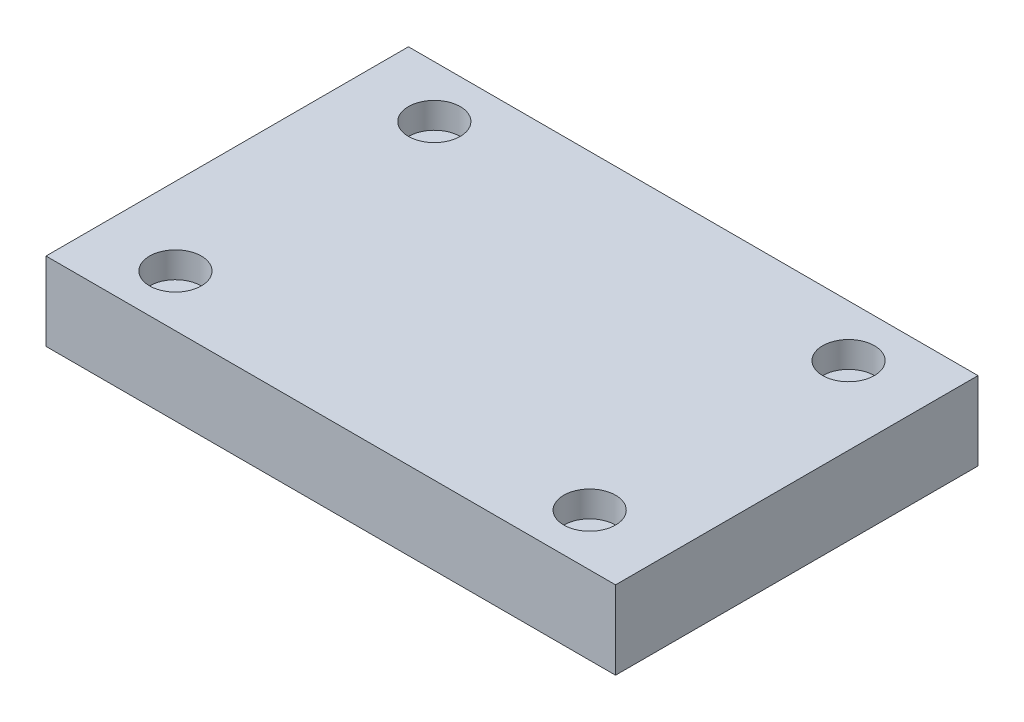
ISO-10303-21;
HEADER;
FILE_DESCRIPTION(('STEP AP214'),'2;1');
FILE_NAME('part.step','',(''),(''),'','','');
FILE_SCHEMA(('AUTOMOTIVE_DESIGN { 1 0 10303 214 1 1 1 1 }'));
ENDSEC;
DATA;
#1=APPLICATION_CONTEXT('core data for automotive mechanical design processes');
#2=APPLICATION_PROTOCOL_DEFINITION('international standard','automotive_design',2000,#1);
#3=PRODUCT_CONTEXT('',#1,'mechanical');
#4=PRODUCT('Part','Part','',(#3));
#5=PRODUCT_RELATED_PRODUCT_CATEGORY('part','',(#4));
#6=PRODUCT_DEFINITION_FORMATION('','',#4);
#7=PRODUCT_DEFINITION_CONTEXT('part definition',#1,'design');
#8=PRODUCT_DEFINITION('design','',#6,#7);
#9=PRODUCT_DEFINITION_SHAPE('','',#8);
#10=(LENGTH_UNIT() NAMED_UNIT(*) SI_UNIT(.MILLI.,.METRE.));
#11=(NAMED_UNIT(*) PLANE_ANGLE_UNIT() SI_UNIT($,.RADIAN.));
#12=(NAMED_UNIT(*) SI_UNIT($,.STERADIAN.) SOLID_ANGLE_UNIT());
#13=UNCERTAINTY_MEASURE_WITH_UNIT(LENGTH_MEASURE(1.E-05),#10,'distance_accuracy_value','');
#14=(GEOMETRIC_REPRESENTATION_CONTEXT(3) GLOBAL_UNCERTAINTY_ASSIGNED_CONTEXT((#13)) GLOBAL_UNIT_ASSIGNED_CONTEXT((#10,
#11,#12)) REPRESENTATION_CONTEXT('',''));
#15=CARTESIAN_POINT('',(0.,0.,0.));
#16=DIRECTION('',(0.,0.,1.));
#17=DIRECTION('',(1.,0.,0.));
#18=AXIS2_PLACEMENT_3D('',#15,#16,#17);
#19=CARTESIAN_POINT('',(-69.85,19.203523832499,-44.45));
#20=DIRECTION('',(1.,0.,0.));
#21=DIRECTION('',(0.,0.,-1.));
#22=AXIS2_PLACEMENT_3D('',#19,#20,#21);
#23=PLANE('',#22);
#24=DIRECTION('',(0.,0.,1.));
#25=VECTOR('',#24,1.);
#26=CARTESIAN_POINT('',(-69.85,0.,-44.45));
#27=LINE('',#26,#25);
#28=CARTESIAN_POINT('',(-69.85,0.,-44.45));
#29=VERTEX_POINT('',#28);
#30=CARTESIAN_POINT('',(-69.85,0.,44.45));
#31=VERTEX_POINT('',#30);
#32=EDGE_CURVE('E85',#29,#31,#27,.T.);
#33=ORIENTED_EDGE('',*,*,#32,.T.);
#34=DIRECTION('',(0.,-1.,0.));
#35=VECTOR('',#34,1.);
#36=CARTESIAN_POINT('',(-69.85,19.203523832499,44.45));
#37=LINE('',#36,#35);
#38=CARTESIAN_POINT('',(-69.85,19.203523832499,44.45));
#39=VERTEX_POINT('',#38);
#40=EDGE_CURVE('E12',#39,#31,#37,.T.);
#41=ORIENTED_EDGE('',*,*,#40,.F.);
#42=DIRECTION('',(0.,0.,1.));
#43=VECTOR('',#42,1.);
#44=CARTESIAN_POINT('',(-69.85,19.203523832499,-44.45));
#45=LINE('',#44,#43);
#46=CARTESIAN_POINT('',(-69.85,19.203523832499,-44.45));
#47=VERTEX_POINT('',#46);
#48=EDGE_CURVE('E108',#47,#39,#45,.T.);
#49=ORIENTED_EDGE('',*,*,#48,.F.);
#50=DIRECTION('',(0.,-1.,0.));
#51=VECTOR('',#50,1.);
#52=CARTESIAN_POINT('',(-69.85,19.203523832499,-44.45));
#53=LINE('',#52,#51);
#54=EDGE_CURVE('E97',#47,#29,#53,.T.);
#55=ORIENTED_EDGE('',*,*,#54,.T.);
#56=EDGE_LOOP('',(#33,#41,#49,#55));
#57=FACE_BOUND('',#56,.T.);
#58=ADVANCED_FACE('F41',(#57),#23,.F.);
#59=CARTESIAN_POINT('',(-69.85,19.203523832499,44.45));
#60=DIRECTION('',(0.,0.,-1.));
#61=DIRECTION('',(-1.,0.,0.));
#62=AXIS2_PLACEMENT_3D('',#59,#60,#61);
#63=PLANE('',#62);
#64=DIRECTION('',(1.,0.,0.));
#65=VECTOR('',#64,1.);
#66=CARTESIAN_POINT('',(-69.85,0.,44.45));
#67=LINE('',#66,#65);
#68=CARTESIAN_POINT('',(69.85,0.,44.45));
#69=VERTEX_POINT('',#68);
#70=EDGE_CURVE('E81',#31,#69,#67,.T.);
#71=ORIENTED_EDGE('',*,*,#70,.T.);
#72=DIRECTION('',(0.,-1.,0.));
#73=VECTOR('',#72,1.);
#74=CARTESIAN_POINT('',(69.85,19.203523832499,44.45));
#75=LINE('',#74,#73);
#76=CARTESIAN_POINT('',(69.85,19.203523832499,44.45));
#77=VERTEX_POINT('',#76);
#78=EDGE_CURVE('E48',#77,#69,#75,.T.);
#79=ORIENTED_EDGE('',*,*,#78,.F.);
#80=DIRECTION('',(1.,0.,0.));
#81=VECTOR('',#80,1.);
#82=CARTESIAN_POINT('',(-69.85,19.203523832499,44.45));
#83=LINE('',#82,#81);
#84=EDGE_CURVE('E93',#39,#77,#83,.T.);
#85=ORIENTED_EDGE('',*,*,#84,.F.);
#86=ORIENTED_EDGE('',*,*,#40,.T.);
#87=EDGE_LOOP('',(#71,#79,#85,#86));
#88=FACE_BOUND('',#87,.T.);
#89=ADVANCED_FACE('F92',(#88),#63,.F.);
#90=CARTESIAN_POINT('',(69.85,19.203523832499,-44.45));
#91=DIRECTION('',(-1.,0.,0.));
#92=DIRECTION('',(0.,0.,1.));
#93=AXIS2_PLACEMENT_3D('',#90,#91,#92);
#94=PLANE('',#93);
#95=DIRECTION('',(0.,0.,-1.));
#96=VECTOR('',#95,1.);
#97=CARTESIAN_POINT('',(69.85,0.,-44.45));
#98=LINE('',#97,#96);
#99=CARTESIAN_POINT('',(69.85,0.,-44.45));
#100=VERTEX_POINT('',#99);
#101=EDGE_CURVE('E86',#69,#100,#98,.T.);
#102=ORIENTED_EDGE('',*,*,#101,.T.);
#103=DIRECTION('',(0.,-1.,0.));
#104=VECTOR('',#103,1.);
#105=CARTESIAN_POINT('',(69.85,19.203523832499,-44.45));
#106=LINE('',#105,#104);
#107=CARTESIAN_POINT('',(69.85,19.203523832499,-44.45));
#108=VERTEX_POINT('',#107);
#109=EDGE_CURVE('E115',#108,#100,#106,.T.);
#110=ORIENTED_EDGE('',*,*,#109,.F.);
#111=DIRECTION('',(0.,0.,-1.));
#112=VECTOR('',#111,1.);
#113=CARTESIAN_POINT('',(69.85,19.203523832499,-44.45));
#114=LINE('',#113,#112);
#115=EDGE_CURVE('E60',#77,#108,#114,.T.);
#116=ORIENTED_EDGE('',*,*,#115,.F.);
#117=ORIENTED_EDGE('',*,*,#78,.T.);
#118=EDGE_LOOP('',(#102,#110,#116,#117));
#119=FACE_BOUND('',#118,.T.);
#120=ADVANCED_FACE('F118',(#119),#94,.F.);
#121=CARTESIAN_POINT('',(-69.85,19.203523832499,-44.45));
#122=DIRECTION('',(0.,0.,1.));
#123=DIRECTION('',(1.,0.,0.));
#124=AXIS2_PLACEMENT_3D('',#121,#122,#123);
#125=PLANE('',#124);
#126=DIRECTION('',(-1.,0.,0.));
#127=VECTOR('',#126,1.);
#128=CARTESIAN_POINT('',(-69.85,0.,-44.45));
#129=LINE('',#128,#127);
#130=EDGE_CURVE('E106',#100,#29,#129,.T.);
#131=ORIENTED_EDGE('',*,*,#130,.T.);
#132=ORIENTED_EDGE('',*,*,#54,.F.);
#133=DIRECTION('',(-1.,0.,0.));
#134=VECTOR('',#133,1.);
#135=CARTESIAN_POINT('',(-69.85,19.203523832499,-44.45));
#136=LINE('',#135,#134);
#137=EDGE_CURVE('E55',#108,#47,#136,.T.);
#138=ORIENTED_EDGE('',*,*,#137,.F.);
#139=ORIENTED_EDGE('',*,*,#109,.T.);
#140=EDGE_LOOP('',(#131,#132,#138,#139));
#141=FACE_BOUND('',#140,.T.);
#142=ADVANCED_FACE('F120',(#141),#125,.F.);
#143=CARTESIAN_POINT('',(-69.85,19.203523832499,44.45));
#144=DIRECTION('',(0.,1.,0.));
#145=DIRECTION('',(0.,0.,1.));
#146=AXIS2_PLACEMENT_3D('',#143,#144,#145);
#147=PLANE('',#146);
#148=CARTESIAN_POINT('',(-50.8,19.203523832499,-31.75));
#149=DIRECTION('',(0.,1.,0.));
#150=DIRECTION('',(0.,0.,1.));
#151=AXIS2_PLACEMENT_3D('',#148,#149,#150);
#152=CIRCLE('',#151,6.35);
#153=CARTESIAN_POINT('',(-50.8,19.203523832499,-25.4));
#154=VERTEX_POINT('',#153);
#155=EDGE_CURVE('E259',#154,#154,#152,.T.);
#156=ORIENTED_EDGE('',*,*,#155,.F.);
#157=EDGE_LOOP('',(#156));
#158=FACE_BOUND('',#157,.T.);
#159=CARTESIAN_POINT('',(-50.8,19.203523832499,31.75));
#160=DIRECTION('',(0.,1.,0.));
#161=DIRECTION('',(0.,0.,1.));
#162=AXIS2_PLACEMENT_3D('',#159,#160,#161);
#163=CIRCLE('',#162,6.35);
#164=CARTESIAN_POINT('',(-50.8,19.203523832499,38.1));
#165=VERTEX_POINT('',#164);
#166=EDGE_CURVE('E258',#165,#165,#163,.T.);
#167=ORIENTED_EDGE('',*,*,#166,.F.);
#168=EDGE_LOOP('',(#167));
#169=FACE_BOUND('',#168,.T.);
#170=CARTESIAN_POINT('',(50.8,19.203523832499,-31.75));
#171=DIRECTION('',(0.,1.,0.));
#172=DIRECTION('',(0.,0.,1.));
#173=AXIS2_PLACEMENT_3D('',#170,#171,#172);
#174=CIRCLE('',#173,6.35);
#175=CARTESIAN_POINT('',(50.8,19.203523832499,-25.4));
#176=VERTEX_POINT('',#175);
#177=EDGE_CURVE('E269',#176,#176,#174,.T.);
#178=ORIENTED_EDGE('',*,*,#177,.F.);
#179=EDGE_LOOP('',(#178));
#180=FACE_BOUND('',#179,.T.);
#181=CARTESIAN_POINT('',(50.8,19.203523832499,31.75));
#182=DIRECTION('',(0.,1.,0.));
#183=DIRECTION('',(0.,0.,1.));
#184=AXIS2_PLACEMENT_3D('',#181,#182,#183);
#185=CIRCLE('',#184,6.35);
#186=CARTESIAN_POINT('',(50.8,19.203523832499,38.1));
#187=VERTEX_POINT('',#186);
#188=EDGE_CURVE('E101',#187,#187,#185,.T.);
#189=ORIENTED_EDGE('',*,*,#188,.F.);
#190=EDGE_LOOP('',(#189));
#191=FACE_BOUND('',#190,.T.);
#192=ORIENTED_EDGE('',*,*,#48,.T.);
#193=ORIENTED_EDGE('',*,*,#84,.T.);
#194=ORIENTED_EDGE('',*,*,#115,.T.);
#195=ORIENTED_EDGE('',*,*,#137,.T.);
#196=EDGE_LOOP('',(#192,#193,#194,#195));
#197=FACE_BOUND('',#196,.T.);
#198=ADVANCED_FACE('F121',(#158,#169,#180,#191,#197),#147,.T.);
#199=CARTESIAN_POINT('',(-69.85,0.,44.45));
#200=DIRECTION('',(0.,1.,0.));
#201=DIRECTION('',(0.,0.,1.));
#202=AXIS2_PLACEMENT_3D('',#199,#200,#201);
#203=PLANE('',#202);
#204=ORIENTED_EDGE('',*,*,#32,.F.);
#205=ORIENTED_EDGE('',*,*,#130,.F.);
#206=ORIENTED_EDGE('',*,*,#101,.F.);
#207=ORIENTED_EDGE('',*,*,#70,.F.);
#208=EDGE_LOOP('',(#204,#205,#206,#207));
#209=FACE_BOUND('',#208,.T.);
#210=ADVANCED_FACE('F82',(#209),#203,.F.);
#211=CARTESIAN_POINT('',(50.8,12.853523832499,31.75));
#212=DIRECTION('',(0.,1.,0.));
#213=DIRECTION('',(0.,0.,1.));
#214=AXIS2_PLACEMENT_3D('',#211,#212,#213);
#215=CYLINDRICAL_SURFACE('',#214,6.35);
#216=CARTESIAN_POINT('',(50.8,12.853523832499,31.75));
#217=DIRECTION('',(0.,1.,0.));
#218=DIRECTION('',(0.,0.,1.));
#219=AXIS2_PLACEMENT_3D('',#216,#217,#218);
#220=CIRCLE('',#219,6.35);
#221=CARTESIAN_POINT('',(50.8,12.853523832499,38.1));
#222=VERTEX_POINT('',#221);
#223=EDGE_CURVE('E98',#222,#222,#220,.T.);
#224=ORIENTED_EDGE('',*,*,#223,.F.);
#225=EDGE_LOOP('',(#224));
#226=FACE_BOUND('',#225,.T.);
#227=ORIENTED_EDGE('',*,*,#188,.T.);
#228=EDGE_LOOP('',(#227));
#229=FACE_BOUND('',#228,.T.);
#230=ADVANCED_FACE('F127',(#226,#229),#215,.F.);
#231=CARTESIAN_POINT('',(50.8,12.853523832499,31.75));
#232=DIRECTION('',(0.,1.,0.));
#233=DIRECTION('',(0.,0.,1.));
#234=AXIS2_PLACEMENT_3D('',#231,#232,#233);
#235=PLANE('',#234);
#236=ORIENTED_EDGE('',*,*,#223,.T.);
#237=EDGE_LOOP('',(#236));
#238=FACE_BOUND('',#237,.T.);
#239=ADVANCED_FACE('F162',(#238),#235,.T.);
#240=CARTESIAN_POINT('',(50.8,12.853523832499,-31.75));
#241=DIRECTION('',(0.,1.,0.));
#242=DIRECTION('',(0.,0.,1.));
#243=AXIS2_PLACEMENT_3D('',#240,#241,#242);
#244=CYLINDRICAL_SURFACE('',#243,6.35);
#245=CARTESIAN_POINT('',(50.8,12.853523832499,-31.75));
#246=DIRECTION('',(0.,1.,0.));
#247=DIRECTION('',(0.,0.,1.));
#248=AXIS2_PLACEMENT_3D('',#245,#246,#247);
#249=CIRCLE('',#248,6.35);
#250=CARTESIAN_POINT('',(50.8,12.853523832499,-25.4));
#251=VERTEX_POINT('',#250);
#252=EDGE_CURVE('E272',#251,#251,#249,.T.);
#253=ORIENTED_EDGE('',*,*,#252,.F.);
#254=EDGE_LOOP('',(#253));
#255=FACE_BOUND('',#254,.T.);
#256=ORIENTED_EDGE('',*,*,#177,.T.);
#257=EDGE_LOOP('',(#256));
#258=FACE_BOUND('',#257,.T.);
#259=ADVANCED_FACE('F170',(#255,#258),#244,.F.);
#260=CARTESIAN_POINT('',(50.8,12.853523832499,-31.75));
#261=DIRECTION('',(0.,1.,0.));
#262=DIRECTION('',(0.,0.,1.));
#263=AXIS2_PLACEMENT_3D('',#260,#261,#262);
#264=PLANE('',#263);
#265=ORIENTED_EDGE('',*,*,#252,.T.);
#266=EDGE_LOOP('',(#265));
#267=FACE_BOUND('',#266,.T.);
#268=ADVANCED_FACE('F178',(#267),#264,.T.);
#269=CARTESIAN_POINT('',(-50.8,12.853523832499,31.75));
#270=DIRECTION('',(0.,1.,0.));
#271=DIRECTION('',(0.,0.,1.));
#272=AXIS2_PLACEMENT_3D('',#269,#270,#271);
#273=CYLINDRICAL_SURFACE('',#272,6.35);
#274=CARTESIAN_POINT('',(-50.8,12.853523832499,31.75));
#275=DIRECTION('',(0.,1.,0.));
#276=DIRECTION('',(0.,0.,1.));
#277=AXIS2_PLACEMENT_3D('',#274,#275,#276);
#278=CIRCLE('',#277,6.35);
#279=CARTESIAN_POINT('',(-50.8,12.853523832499,38.1));
#280=VERTEX_POINT('',#279);
#281=EDGE_CURVE('E262',#280,#280,#278,.T.);
#282=ORIENTED_EDGE('',*,*,#281,.F.);
#283=EDGE_LOOP('',(#282));
#284=FACE_BOUND('',#283,.T.);
#285=ORIENTED_EDGE('',*,*,#166,.T.);
#286=EDGE_LOOP('',(#285));
#287=FACE_BOUND('',#286,.T.);
#288=ADVANCED_FACE('F186',(#284,#287),#273,.F.);
#289=CARTESIAN_POINT('',(-50.8,12.853523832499,31.75));
#290=DIRECTION('',(0.,1.,0.));
#291=DIRECTION('',(0.,0.,1.));
#292=AXIS2_PLACEMENT_3D('',#289,#290,#291);
#293=PLANE('',#292);
#294=ORIENTED_EDGE('',*,*,#281,.T.);
#295=EDGE_LOOP('',(#294));
#296=FACE_BOUND('',#295,.T.);
#297=ADVANCED_FACE('F194',(#296),#293,.T.);
#298=CARTESIAN_POINT('',(-50.8,12.853523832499,-31.75));
#299=DIRECTION('',(0.,1.,0.));
#300=DIRECTION('',(0.,0.,1.));
#301=AXIS2_PLACEMENT_3D('',#298,#299,#300);
#302=CYLINDRICAL_SURFACE('',#301,6.35);
#303=CARTESIAN_POINT('',(-50.8,12.853523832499,-31.75));
#304=DIRECTION('',(0.,1.,0.));
#305=DIRECTION('',(0.,0.,1.));
#306=AXIS2_PLACEMENT_3D('',#303,#304,#305);
#307=CIRCLE('',#306,6.35);
#308=CARTESIAN_POINT('',(-50.8,12.853523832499,-25.4));
#309=VERTEX_POINT('',#308);
#310=EDGE_CURVE('E257',#309,#309,#307,.T.);
#311=ORIENTED_EDGE('',*,*,#310,.F.);
#312=EDGE_LOOP('',(#311));
#313=FACE_BOUND('',#312,.T.);
#314=ORIENTED_EDGE('',*,*,#155,.T.);
#315=EDGE_LOOP('',(#314));
#316=FACE_BOUND('',#315,.T.);
#317=ADVANCED_FACE('F202',(#313,#316),#302,.F.);
#318=CARTESIAN_POINT('',(-50.8,12.853523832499,-31.75));
#319=DIRECTION('',(0.,1.,0.));
#320=DIRECTION('',(0.,0.,1.));
#321=AXIS2_PLACEMENT_3D('',#318,#319,#320);
#322=PLANE('',#321);
#323=ORIENTED_EDGE('',*,*,#310,.T.);
#324=EDGE_LOOP('',(#323));
#325=FACE_BOUND('',#324,.T.);
#326=ADVANCED_FACE('F210',(#325),#322,.T.);
#327=CLOSED_SHELL('',(#58,#89,#120,#142,#198,#210,#230,#239,#259,#268,#288,#297,#317,#326));
#328=MANIFOLD_SOLID_BREP('B2',#327);
#329=ADVANCED_BREP_SHAPE_REPRESENTATION('',(#18,#328),#14);
#330=SHAPE_DEFINITION_REPRESENTATION(#9,#329);
ENDSEC;
END-ISO-10303-21;
